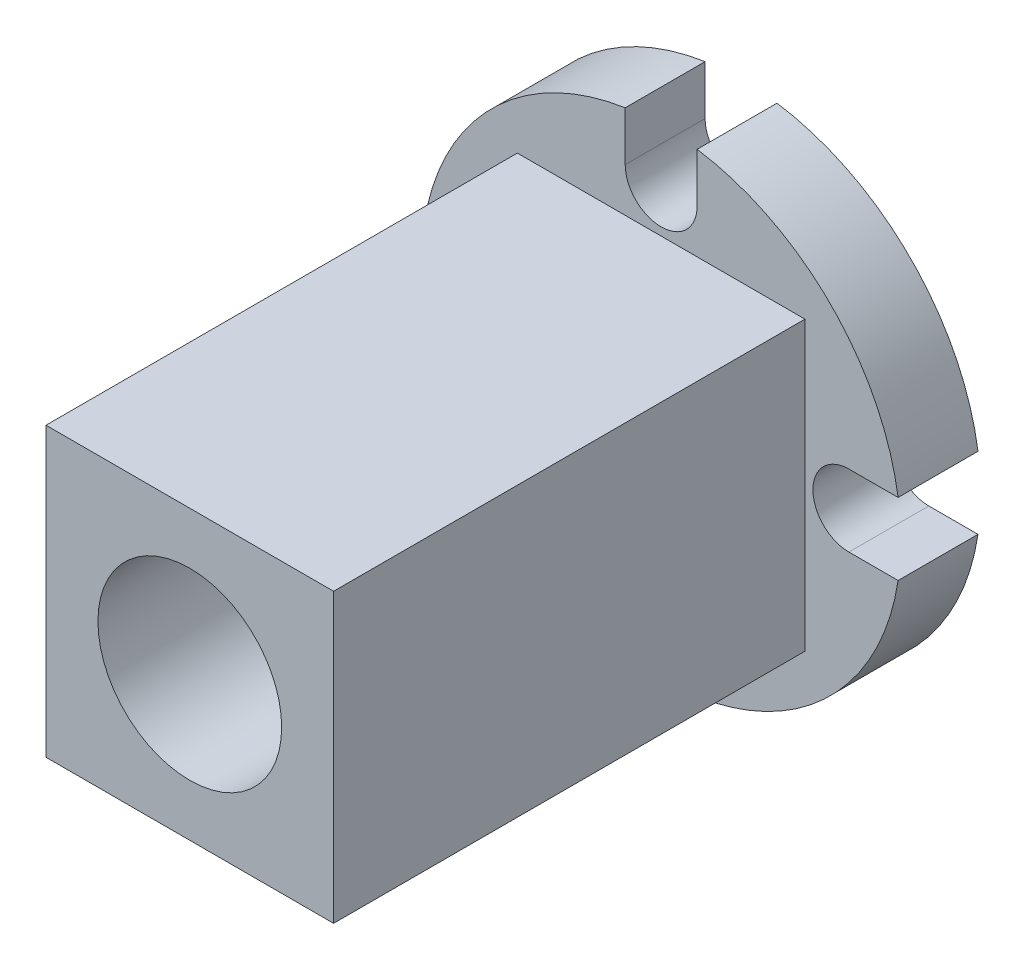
ISO-10303-21;
HEADER;
FILE_DESCRIPTION(('STEP AP214'),'2;1');
FILE_NAME('part.step','',(''),(''),'','','');
FILE_SCHEMA(('AUTOMOTIVE_DESIGN { 1 0 10303 214 1 1 1 1 }'));
ENDSEC;
DATA;
#1=APPLICATION_CONTEXT('core data for automotive mechanical design processes');
#2=APPLICATION_PROTOCOL_DEFINITION('international standard','automotive_design',2000,#1);
#3=PRODUCT_CONTEXT('',#1,'mechanical');
#4=PRODUCT('Part','Part','',(#3));
#5=PRODUCT_RELATED_PRODUCT_CATEGORY('part','',(#4));
#6=PRODUCT_DEFINITION_FORMATION('','',#4);
#7=PRODUCT_DEFINITION_CONTEXT('part definition',#1,'design');
#8=PRODUCT_DEFINITION('design','',#6,#7);
#9=PRODUCT_DEFINITION_SHAPE('','',#8);
#10=(LENGTH_UNIT() NAMED_UNIT(*) SI_UNIT(.MILLI.,.METRE.));
#11=(NAMED_UNIT(*) PLANE_ANGLE_UNIT() SI_UNIT($,.RADIAN.));
#12=(NAMED_UNIT(*) SI_UNIT($,.STERADIAN.) SOLID_ANGLE_UNIT());
#13=UNCERTAINTY_MEASURE_WITH_UNIT(LENGTH_MEASURE(1.E-05),#10,'distance_accuracy_value','');
#14=(GEOMETRIC_REPRESENTATION_CONTEXT(3) GLOBAL_UNCERTAINTY_ASSIGNED_CONTEXT((#13)) GLOBAL_UNIT_ASSIGNED_CONTEXT((#10,
#11,#12)) REPRESENTATION_CONTEXT('',''));
#15=CARTESIAN_POINT('',(0.,0.,0.));
#16=DIRECTION('',(0.,0.,1.));
#17=DIRECTION('',(1.,0.,0.));
#18=AXIS2_PLACEMENT_3D('',#15,#16,#17);
#19=CARTESIAN_POINT('',(-18.,18.,69.));
#20=DIRECTION('',(0.,0.,1.));
#21=DIRECTION('',(0.,-1.,0.));
#22=AXIS2_PLACEMENT_3D('',#19,#20,#21);
#23=PLANE('',#22);
#24=DIRECTION('',(-1.,0.,0.));
#25=VECTOR('',#24,1.);
#26=CARTESIAN_POINT('',(18.,18.,69.));
#27=LINE('',#26,#25);
#28=CARTESIAN_POINT('',(18.,18.,69.));
#29=VERTEX_POINT('',#28);
#30=CARTESIAN_POINT('',(-18.,18.,69.));
#31=VERTEX_POINT('',#30);
#32=EDGE_CURVE('E406',#29,#31,#27,.T.);
#33=ORIENTED_EDGE('',*,*,#32,.T.);
#34=DIRECTION('',(0.,-1.,0.));
#35=VECTOR('',#34,1.);
#36=CARTESIAN_POINT('',(-18.,18.,69.));
#37=LINE('',#36,#35);
#38=CARTESIAN_POINT('',(-18.,-18.,69.));
#39=VERTEX_POINT('',#38);
#40=EDGE_CURVE('E421',#31,#39,#37,.T.);
#41=ORIENTED_EDGE('',*,*,#40,.T.);
#42=DIRECTION('',(1.,0.,0.));
#43=VECTOR('',#42,1.);
#44=CARTESIAN_POINT('',(18.,-18.,69.));
#45=LINE('',#44,#43);
#46=CARTESIAN_POINT('',(18.,-18.,69.));
#47=VERTEX_POINT('',#46);
#48=EDGE_CURVE('E418',#39,#47,#45,.T.);
#49=ORIENTED_EDGE('',*,*,#48,.T.);
#50=DIRECTION('',(0.,1.,0.));
#51=VECTOR('',#50,1.);
#52=CARTESIAN_POINT('',(18.,18.,69.));
#53=LINE('',#52,#51);
#54=EDGE_CURVE('E403',#47,#29,#53,.T.);
#55=ORIENTED_EDGE('',*,*,#54,.T.);
#56=EDGE_LOOP('',(#33,#41,#49,#55));
#57=FACE_BOUND('',#56,.T.);
#58=CARTESIAN_POINT('',(0.,0.,69.));
#59=DIRECTION('',(0.,0.,1.));
#60=DIRECTION('',(1.,0.,0.));
#61=AXIS2_PLACEMENT_3D('',#58,#59,#60);
#62=CIRCLE('',#61,11.5);
#63=CARTESIAN_POINT('',(11.5,0.,69.));
#64=VERTEX_POINT('',#63);
#65=EDGE_CURVE('E415',#64,#64,#62,.T.);
#66=ORIENTED_EDGE('',*,*,#65,.F.);
#67=EDGE_LOOP('',(#66));
#68=FACE_BOUND('',#67,.T.);
#69=ADVANCED_FACE('F14',(#57,#68),#23,.T.);
#70=CARTESIAN_POINT('',(0.,0.,10.));
#71=DIRECTION('',(0.,0.,1.));
#72=DIRECTION('',(0.,-1.,0.));
#73=AXIS2_PLACEMENT_3D('',#70,#71,#72);
#74=PLANE('',#73);
#75=CARTESIAN_POINT('',(0.,0.,10.));
#76=DIRECTION('',(0.,0.,1.));
#77=DIRECTION('',(0.,-1.,0.));
#78=AXIS2_PLACEMENT_3D('',#75,#76,#77);
#79=CIRCLE('',#78,30.);
#80=CARTESIAN_POINT('',(29.6605798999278,4.5,10.));
#81=VERTEX_POINT('',#80);
#82=CARTESIAN_POINT('',(4.5,29.6605798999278,10.));
#83=VERTEX_POINT('',#82);
#84=EDGE_CURVE('E205',#81,#83,#79,.T.);
#85=ORIENTED_EDGE('',*,*,#84,.T.);
#86=DIRECTION('',(0.,-1.,0.));
#87=VECTOR('',#86,1.);
#88=CARTESIAN_POINT('',(4.5,29.6605798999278,10.));
#89=LINE('',#88,#87);
#90=CARTESIAN_POINT('',(4.5,23.5,10.));
#91=VERTEX_POINT('',#90);
#92=EDGE_CURVE('E104',#83,#91,#89,.T.);
#93=ORIENTED_EDGE('',*,*,#92,.T.);
#94=CARTESIAN_POINT('',(0.,23.5,10.));
#95=DIRECTION('',(0.,0.,-1.));
#96=DIRECTION('',(0.,-1.,0.));
#97=AXIS2_PLACEMENT_3D('',#94,#95,#96);
#98=CIRCLE('',#97,4.5);
#99=CARTESIAN_POINT('',(-4.5,23.5,10.));
#100=VERTEX_POINT('',#99);
#101=EDGE_CURVE('E364',#91,#100,#98,.T.);
#102=ORIENTED_EDGE('',*,*,#101,.T.);
#103=DIRECTION('',(0.,1.,0.));
#104=VECTOR('',#103,1.);
#105=CARTESIAN_POINT('',(-4.5,29.6605798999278,10.));
#106=LINE('',#105,#104);
#107=CARTESIAN_POINT('',(-4.5,29.6605798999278,10.));
#108=VERTEX_POINT('',#107);
#109=EDGE_CURVE('E366',#100,#108,#106,.T.);
#110=ORIENTED_EDGE('',*,*,#109,.T.);
#111=CARTESIAN_POINT('',(0.,0.,10.));
#112=DIRECTION('',(0.,0.,1.));
#113=DIRECTION('',(0.,-1.,0.));
#114=AXIS2_PLACEMENT_3D('',#111,#112,#113);
#115=CIRCLE('',#114,30.);
#116=CARTESIAN_POINT('',(-29.6605798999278,4.5,10.));
#117=VERTEX_POINT('',#116);
#118=EDGE_CURVE('E368',#108,#117,#115,.T.);
#119=ORIENTED_EDGE('',*,*,#118,.T.);
#120=DIRECTION('',(1.,0.,0.));
#121=VECTOR('',#120,1.);
#122=CARTESIAN_POINT('',(-29.6605798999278,4.5,10.));
#123=LINE('',#122,#121);
#124=CARTESIAN_POINT('',(-23.5,4.5,10.));
#125=VERTEX_POINT('',#124);
#126=EDGE_CURVE('E374',#117,#125,#123,.T.);
#127=ORIENTED_EDGE('',*,*,#126,.T.);
#128=CARTESIAN_POINT('',(-23.5,0.,10.));
#129=DIRECTION('',(0.,0.,-1.));
#130=DIRECTION('',(0.,-1.,0.));
#131=AXIS2_PLACEMENT_3D('',#128,#129,#130);
#132=CIRCLE('',#131,4.5);
#133=CARTESIAN_POINT('',(-23.5,-4.5,10.));
#134=VERTEX_POINT('',#133);
#135=EDGE_CURVE('E376',#125,#134,#132,.T.);
#136=ORIENTED_EDGE('',*,*,#135,.T.);
#137=DIRECTION('',(-1.,0.,0.));
#138=VECTOR('',#137,1.);
#139=CARTESIAN_POINT('',(-29.6605798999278,-4.5,10.));
#140=LINE('',#139,#138);
#141=CARTESIAN_POINT('',(-29.6605798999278,-4.5,10.));
#142=VERTEX_POINT('',#141);
#143=EDGE_CURVE('E378',#134,#142,#140,.T.);
#144=ORIENTED_EDGE('',*,*,#143,.T.);
#145=CARTESIAN_POINT('',(0.,0.,10.));
#146=DIRECTION('',(0.,0.,1.));
#147=DIRECTION('',(0.,-1.,0.));
#148=AXIS2_PLACEMENT_3D('',#145,#146,#147);
#149=CIRCLE('',#148,30.);
#150=CARTESIAN_POINT('',(-4.5,-29.6605798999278,10.));
#151=VERTEX_POINT('',#150);
#152=EDGE_CURVE('E380',#142,#151,#149,.T.);
#153=ORIENTED_EDGE('',*,*,#152,.T.);
#154=DIRECTION('',(0.,1.,0.));
#155=VECTOR('',#154,1.);
#156=CARTESIAN_POINT('',(-4.5,-29.6605798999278,10.));
#157=LINE('',#156,#155);
#158=CARTESIAN_POINT('',(-4.5,-23.5,10.));
#159=VERTEX_POINT('',#158);
#160=EDGE_CURVE('E382',#151,#159,#157,.T.);
#161=ORIENTED_EDGE('',*,*,#160,.T.);
#162=CARTESIAN_POINT('',(0.,-23.5,10.));
#163=DIRECTION('',(0.,0.,-1.));
#164=DIRECTION('',(0.,-1.,0.));
#165=AXIS2_PLACEMENT_3D('',#162,#163,#164);
#166=CIRCLE('',#165,4.5);
#167=CARTESIAN_POINT('',(4.5,-23.5,10.));
#168=VERTEX_POINT('',#167);
#169=EDGE_CURVE('E384',#159,#168,#166,.T.);
#170=ORIENTED_EDGE('',*,*,#169,.T.);
#171=DIRECTION('',(0.,-1.,0.));
#172=VECTOR('',#171,1.);
#173=CARTESIAN_POINT('',(4.5,-29.6605798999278,10.));
#174=LINE('',#173,#172);
#175=CARTESIAN_POINT('',(4.5,-29.6605798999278,10.));
#176=VERTEX_POINT('',#175);
#177=EDGE_CURVE('E386',#168,#176,#174,.T.);
#178=ORIENTED_EDGE('',*,*,#177,.T.);
#179=CARTESIAN_POINT('',(0.,0.,10.));
#180=DIRECTION('',(0.,0.,1.));
#181=DIRECTION('',(0.,-1.,0.));
#182=AXIS2_PLACEMENT_3D('',#179,#180,#181);
#183=CIRCLE('',#182,30.);
#184=CARTESIAN_POINT('',(29.6605798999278,-4.5,10.));
#185=VERTEX_POINT('',#184);
#186=EDGE_CURVE('E152',#176,#185,#183,.T.);
#187=ORIENTED_EDGE('',*,*,#186,.T.);
#188=DIRECTION('',(-1.,0.,0.));
#189=VECTOR('',#188,1.);
#190=CARTESIAN_POINT('',(29.6605798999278,-4.5,10.));
#191=LINE('',#190,#189);
#192=CARTESIAN_POINT('',(23.5,-4.5,10.));
#193=VERTEX_POINT('',#192);
#194=EDGE_CURVE('E144',#185,#193,#191,.T.);
#195=ORIENTED_EDGE('',*,*,#194,.T.);
#196=CARTESIAN_POINT('',(23.5,0.,10.));
#197=DIRECTION('',(0.,0.,-1.));
#198=DIRECTION('',(0.,-1.,0.));
#199=AXIS2_PLACEMENT_3D('',#196,#197,#198);
#200=CIRCLE('',#199,4.5);
#201=CARTESIAN_POINT('',(23.5,4.5,10.));
#202=VERTEX_POINT('',#201);
#203=EDGE_CURVE('E149',#193,#202,#200,.T.);
#204=ORIENTED_EDGE('',*,*,#203,.T.);
#205=DIRECTION('',(1.,0.,0.));
#206=VECTOR('',#205,1.);
#207=CARTESIAN_POINT('',(29.6605798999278,4.5,10.));
#208=LINE('',#207,#206);
#209=EDGE_CURVE('E38',#202,#81,#208,.T.);
#210=ORIENTED_EDGE('',*,*,#209,.T.);
#211=EDGE_LOOP('',(#85,#93,#102,#110,#119,#127,#136,#144,#153,#161,#170,#178,#187,#195,#204,#210));
#212=FACE_BOUND('',#211,.T.);
#213=DIRECTION('',(0.,-1.,0.));
#214=VECTOR('',#213,1.);
#215=CARTESIAN_POINT('',(-18.,18.,10.));
#216=LINE('',#215,#214);
#217=CARTESIAN_POINT('',(-18.,18.,10.));
#218=VERTEX_POINT('',#217);
#219=CARTESIAN_POINT('',(-18.,-18.,10.));
#220=VERTEX_POINT('',#219);
#221=EDGE_CURVE('E409',#218,#220,#216,.T.);
#222=ORIENTED_EDGE('',*,*,#221,.F.);
#223=DIRECTION('',(-1.,0.,0.));
#224=VECTOR('',#223,1.);
#225=CARTESIAN_POINT('',(18.,18.,10.));
#226=LINE('',#225,#224);
#227=CARTESIAN_POINT('',(18.,18.,10.));
#228=VERTEX_POINT('',#227);
#229=EDGE_CURVE('E412',#228,#218,#226,.T.);
#230=ORIENTED_EDGE('',*,*,#229,.F.);
#231=DIRECTION('',(0.,1.,0.));
#232=VECTOR('',#231,1.);
#233=CARTESIAN_POINT('',(18.,18.,10.));
#234=LINE('',#233,#232);
#235=CARTESIAN_POINT('',(18.,-18.,10.));
#236=VERTEX_POINT('',#235);
#237=EDGE_CURVE('E404',#236,#228,#234,.T.);
#238=ORIENTED_EDGE('',*,*,#237,.F.);
#239=DIRECTION('',(1.,0.,0.));
#240=VECTOR('',#239,1.);
#241=CARTESIAN_POINT('',(18.,-18.,10.));
#242=LINE('',#241,#240);
#243=EDGE_CURVE('E407',#220,#236,#242,.T.);
#244=ORIENTED_EDGE('',*,*,#243,.F.);
#245=EDGE_LOOP('',(#222,#230,#238,#244));
#246=FACE_BOUND('',#245,.T.);
#247=ADVANCED_FACE('F146',(#212,#246),#74,.T.);
#248=CARTESIAN_POINT('',(0.,0.,10.));
#249=DIRECTION('',(0.,0.,-1.));
#250=DIRECTION('',(0.,1.,0.));
#251=AXIS2_PLACEMENT_3D('',#248,#249,#250);
#252=CYLINDRICAL_SURFACE('',#251,30.);
#253=CARTESIAN_POINT('',(0.,0.,0.));
#254=DIRECTION('',(0.,0.,1.));
#255=DIRECTION('',(0.,-1.,0.));
#256=AXIS2_PLACEMENT_3D('',#253,#254,#255);
#257=CIRCLE('',#256,30.);
#258=CARTESIAN_POINT('',(29.6605798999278,4.5,0.));
#259=VERTEX_POINT('',#258);
#260=CARTESIAN_POINT('',(4.5,29.6605798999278,0.));
#261=VERTEX_POINT('',#260);
#262=EDGE_CURVE('E173',#259,#261,#257,.T.);
#263=ORIENTED_EDGE('',*,*,#262,.T.);
#264=DIRECTION('',(0.,0.,-1.));
#265=VECTOR('',#264,1.);
#266=CARTESIAN_POINT('',(4.5,29.6605798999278,10.));
#267=LINE('',#266,#265);
#268=EDGE_CURVE('E242',#83,#261,#267,.T.);
#269=ORIENTED_EDGE('',*,*,#268,.F.);
#270=ORIENTED_EDGE('',*,*,#84,.F.);
#271=DIRECTION('',(0.,0.,-1.));
#272=VECTOR('',#271,1.);
#273=CARTESIAN_POINT('',(29.6605798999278,4.5,10.));
#274=LINE('',#273,#272);
#275=EDGE_CURVE('E169',#81,#259,#274,.T.);
#276=ORIENTED_EDGE('',*,*,#275,.T.);
#277=EDGE_LOOP('',(#263,#269,#270,#276));
#278=FACE_BOUND('',#277,.T.);
#279=ADVANCED_FACE('F270',(#278),#252,.T.);
#280=CARTESIAN_POINT('',(4.5,29.6605798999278,10.));
#281=DIRECTION('',(1.,0.,0.));
#282=DIRECTION('',(0.,0.,1.));
#283=AXIS2_PLACEMENT_3D('',#280,#281,#282);
#284=PLANE('',#283);
#285=DIRECTION('',(0.,-1.,0.));
#286=VECTOR('',#285,1.);
#287=CARTESIAN_POINT('',(4.5,29.6605798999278,0.));
#288=LINE('',#287,#286);
#289=CARTESIAN_POINT('',(4.5,23.5,0.));
#290=VERTEX_POINT('',#289);
#291=EDGE_CURVE('E176',#261,#290,#288,.T.);
#292=ORIENTED_EDGE('',*,*,#291,.T.);
#293=DIRECTION('',(0.,0.,-1.));
#294=VECTOR('',#293,1.);
#295=CARTESIAN_POINT('',(4.5,23.5,10.));
#296=LINE('',#295,#294);
#297=EDGE_CURVE('E239',#91,#290,#296,.T.);
#298=ORIENTED_EDGE('',*,*,#297,.F.);
#299=ORIENTED_EDGE('',*,*,#92,.F.);
#300=ORIENTED_EDGE('',*,*,#268,.T.);
#301=EDGE_LOOP('',(#292,#298,#299,#300));
#302=FACE_BOUND('',#301,.T.);
#303=ADVANCED_FACE('F348',(#302),#284,.F.);
#304=CARTESIAN_POINT('',(0.,23.5,10.));
#305=DIRECTION('',(0.,0.,-1.));
#306=DIRECTION('',(0.,1.,0.));
#307=AXIS2_PLACEMENT_3D('',#304,#305,#306);
#308=CYLINDRICAL_SURFACE('',#307,4.5);
#309=CARTESIAN_POINT('',(0.,23.5,0.));
#310=DIRECTION('',(0.,0.,-1.));
#311=DIRECTION('',(0.,-1.,0.));
#312=AXIS2_PLACEMENT_3D('',#309,#310,#311);
#313=CIRCLE('',#312,4.5);
#314=CARTESIAN_POINT('',(-4.5,23.5,0.));
#315=VERTEX_POINT('',#314);
#316=EDGE_CURVE('E179',#290,#315,#313,.T.);
#317=ORIENTED_EDGE('',*,*,#316,.T.);
#318=DIRECTION('',(0.,0.,-1.));
#319=VECTOR('',#318,1.);
#320=CARTESIAN_POINT('',(-4.5,23.5,10.));
#321=LINE('',#320,#319);
#322=EDGE_CURVE('E236',#100,#315,#321,.T.);
#323=ORIENTED_EDGE('',*,*,#322,.F.);
#324=ORIENTED_EDGE('',*,*,#101,.F.);
#325=ORIENTED_EDGE('',*,*,#297,.T.);
#326=EDGE_LOOP('',(#317,#323,#324,#325));
#327=FACE_BOUND('',#326,.T.);
#328=ADVANCED_FACE('F344',(#327),#308,.F.);
#329=CARTESIAN_POINT('',(-4.5,29.6605798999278,10.));
#330=DIRECTION('',(-1.,0.,0.));
#331=DIRECTION('',(0.,0.,-1.));
#332=AXIS2_PLACEMENT_3D('',#329,#330,#331);
#333=PLANE('',#332);
#334=DIRECTION('',(0.,1.,0.));
#335=VECTOR('',#334,1.);
#336=CARTESIAN_POINT('',(-4.5,29.6605798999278,0.));
#337=LINE('',#336,#335);
#338=CARTESIAN_POINT('',(-4.5,29.6605798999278,0.));
#339=VERTEX_POINT('',#338);
#340=EDGE_CURVE('E181',#315,#339,#337,.T.);
#341=ORIENTED_EDGE('',*,*,#340,.T.);
#342=DIRECTION('',(0.,0.,-1.));
#343=VECTOR('',#342,1.);
#344=CARTESIAN_POINT('',(-4.5,29.6605798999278,10.));
#345=LINE('',#344,#343);
#346=EDGE_CURVE('E233',#108,#339,#345,.T.);
#347=ORIENTED_EDGE('',*,*,#346,.F.);
#348=ORIENTED_EDGE('',*,*,#109,.F.);
#349=ORIENTED_EDGE('',*,*,#322,.T.);
#350=EDGE_LOOP('',(#341,#347,#348,#349));
#351=FACE_BOUND('',#350,.T.);
#352=ADVANCED_FACE('F340',(#351),#333,.F.);
#353=CARTESIAN_POINT('',(0.,0.,10.));
#354=DIRECTION('',(0.,0.,-1.));
#355=DIRECTION('',(0.,1.,0.));
#356=AXIS2_PLACEMENT_3D('',#353,#354,#355);
#357=CYLINDRICAL_SURFACE('',#356,30.);
#358=CARTESIAN_POINT('',(0.,0.,0.));
#359=DIRECTION('',(0.,0.,1.));
#360=DIRECTION('',(0.,-1.,0.));
#361=AXIS2_PLACEMENT_3D('',#358,#359,#360);
#362=CIRCLE('',#361,30.);
#363=CARTESIAN_POINT('',(-29.6605798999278,4.5,0.));
#364=VERTEX_POINT('',#363);
#365=EDGE_CURVE('E183',#339,#364,#362,.T.);
#366=ORIENTED_EDGE('',*,*,#365,.T.);
#367=DIRECTION('',(0.,0.,-1.));
#368=VECTOR('',#367,1.);
#369=CARTESIAN_POINT('',(-29.6605798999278,4.5,10.));
#370=LINE('',#369,#368);
#371=EDGE_CURVE('E230',#117,#364,#370,.T.);
#372=ORIENTED_EDGE('',*,*,#371,.F.);
#373=ORIENTED_EDGE('',*,*,#118,.F.);
#374=ORIENTED_EDGE('',*,*,#346,.T.);
#375=EDGE_LOOP('',(#366,#372,#373,#374));
#376=FACE_BOUND('',#375,.T.);
#377=ADVANCED_FACE('F336',(#376),#357,.T.);
#378=CARTESIAN_POINT('',(-29.6605798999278,4.5,10.));
#379=DIRECTION('',(0.,1.,0.));
#380=DIRECTION('',(-1.,0.,0.));
#381=AXIS2_PLACEMENT_3D('',#378,#379,#380);
#382=PLANE('',#381);
#383=DIRECTION('',(1.,0.,0.));
#384=VECTOR('',#383,1.);
#385=CARTESIAN_POINT('',(-29.6605798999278,4.5,0.));
#386=LINE('',#385,#384);
#387=CARTESIAN_POINT('',(-23.5,4.5,0.));
#388=VERTEX_POINT('',#387);
#389=EDGE_CURVE('E185',#364,#388,#386,.T.);
#390=ORIENTED_EDGE('',*,*,#389,.T.);
#391=DIRECTION('',(0.,0.,-1.));
#392=VECTOR('',#391,1.);
#393=CARTESIAN_POINT('',(-23.5,4.5,10.));
#394=LINE('',#393,#392);
#395=EDGE_CURVE('E227',#125,#388,#394,.T.);
#396=ORIENTED_EDGE('',*,*,#395,.F.);
#397=ORIENTED_EDGE('',*,*,#126,.F.);
#398=ORIENTED_EDGE('',*,*,#371,.T.);
#399=EDGE_LOOP('',(#390,#396,#397,#398));
#400=FACE_BOUND('',#399,.T.);
#401=ADVANCED_FACE('F332',(#400),#382,.F.);
#402=CARTESIAN_POINT('',(-23.5,0.,10.));
#403=DIRECTION('',(0.,0.,-1.));
#404=DIRECTION('',(0.,1.,0.));
#405=AXIS2_PLACEMENT_3D('',#402,#403,#404);
#406=CYLINDRICAL_SURFACE('',#405,4.5);
#407=CARTESIAN_POINT('',(-23.5,0.,0.));
#408=DIRECTION('',(0.,0.,-1.));
#409=DIRECTION('',(0.,-1.,0.));
#410=AXIS2_PLACEMENT_3D('',#407,#408,#409);
#411=CIRCLE('',#410,4.5);
#412=CARTESIAN_POINT('',(-23.5,-4.5,0.));
#413=VERTEX_POINT('',#412);
#414=EDGE_CURVE('E187',#388,#413,#411,.T.);
#415=ORIENTED_EDGE('',*,*,#414,.T.);
#416=DIRECTION('',(0.,0.,-1.));
#417=VECTOR('',#416,1.);
#418=CARTESIAN_POINT('',(-23.5,-4.5,10.));
#419=LINE('',#418,#417);
#420=EDGE_CURVE('E224',#134,#413,#419,.T.);
#421=ORIENTED_EDGE('',*,*,#420,.F.);
#422=ORIENTED_EDGE('',*,*,#135,.F.);
#423=ORIENTED_EDGE('',*,*,#395,.T.);
#424=EDGE_LOOP('',(#415,#421,#422,#423));
#425=FACE_BOUND('',#424,.T.);
#426=ADVANCED_FACE('F328',(#425),#406,.F.);
#427=CARTESIAN_POINT('',(-29.6605798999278,-4.5,10.));
#428=DIRECTION('',(0.,-1.,0.));
#429=DIRECTION('',(1.,0.,0.));
#430=AXIS2_PLACEMENT_3D('',#427,#428,#429);
#431=PLANE('',#430);
#432=DIRECTION('',(-1.,0.,0.));
#433=VECTOR('',#432,1.);
#434=CARTESIAN_POINT('',(-29.6605798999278,-4.5,0.));
#435=LINE('',#434,#433);
#436=CARTESIAN_POINT('',(-29.6605798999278,-4.5,0.));
#437=VERTEX_POINT('',#436);
#438=EDGE_CURVE('E189',#413,#437,#435,.T.);
#439=ORIENTED_EDGE('',*,*,#438,.T.);
#440=DIRECTION('',(0.,0.,-1.));
#441=VECTOR('',#440,1.);
#442=CARTESIAN_POINT('',(-29.6605798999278,-4.5,10.));
#443=LINE('',#442,#441);
#444=EDGE_CURVE('E221',#142,#437,#443,.T.);
#445=ORIENTED_EDGE('',*,*,#444,.F.);
#446=ORIENTED_EDGE('',*,*,#143,.F.);
#447=ORIENTED_EDGE('',*,*,#420,.T.);
#448=EDGE_LOOP('',(#439,#445,#446,#447));
#449=FACE_BOUND('',#448,.T.);
#450=ADVANCED_FACE('F324',(#449),#431,.F.);
#451=CARTESIAN_POINT('',(0.,0.,10.));
#452=DIRECTION('',(0.,0.,-1.));
#453=DIRECTION('',(0.,1.,0.));
#454=AXIS2_PLACEMENT_3D('',#451,#452,#453);
#455=CYLINDRICAL_SURFACE('',#454,30.);
#456=CARTESIAN_POINT('',(0.,0.,0.));
#457=DIRECTION('',(0.,0.,1.));
#458=DIRECTION('',(0.,-1.,0.));
#459=AXIS2_PLACEMENT_3D('',#456,#457,#458);
#460=CIRCLE('',#459,30.);
#461=CARTESIAN_POINT('',(-4.5,-29.6605798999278,0.));
#462=VERTEX_POINT('',#461);
#463=EDGE_CURVE('E191',#437,#462,#460,.T.);
#464=ORIENTED_EDGE('',*,*,#463,.T.);
#465=DIRECTION('',(0.,0.,-1.));
#466=VECTOR('',#465,1.);
#467=CARTESIAN_POINT('',(-4.5,-29.6605798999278,10.));
#468=LINE('',#467,#466);
#469=EDGE_CURVE('E218',#151,#462,#468,.T.);
#470=ORIENTED_EDGE('',*,*,#469,.F.);
#471=ORIENTED_EDGE('',*,*,#152,.F.);
#472=ORIENTED_EDGE('',*,*,#444,.T.);
#473=EDGE_LOOP('',(#464,#470,#471,#472));
#474=FACE_BOUND('',#473,.T.);
#475=ADVANCED_FACE('F320',(#474),#455,.T.);
#476=CARTESIAN_POINT('',(-4.5,-29.6605798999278,10.));
#477=DIRECTION('',(-1.,0.,0.));
#478=DIRECTION('',(0.,-1.,0.));
#479=AXIS2_PLACEMENT_3D('',#476,#477,#478);
#480=PLANE('',#479);
#481=DIRECTION('',(0.,1.,0.));
#482=VECTOR('',#481,1.);
#483=CARTESIAN_POINT('',(-4.5,-29.6605798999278,0.));
#484=LINE('',#483,#482);
#485=CARTESIAN_POINT('',(-4.5,-23.5,0.));
#486=VERTEX_POINT('',#485);
#487=EDGE_CURVE('E193',#462,#486,#484,.T.);
#488=ORIENTED_EDGE('',*,*,#487,.T.);
#489=DIRECTION('',(0.,0.,-1.));
#490=VECTOR('',#489,1.);
#491=CARTESIAN_POINT('',(-4.5,-23.5,10.));
#492=LINE('',#491,#490);
#493=EDGE_CURVE('E215',#159,#486,#492,.T.);
#494=ORIENTED_EDGE('',*,*,#493,.F.);
#495=ORIENTED_EDGE('',*,*,#160,.F.);
#496=ORIENTED_EDGE('',*,*,#469,.T.);
#497=EDGE_LOOP('',(#488,#494,#495,#496));
#498=FACE_BOUND('',#497,.T.);
#499=ADVANCED_FACE('F316',(#498),#480,.F.);
#500=CARTESIAN_POINT('',(0.,-23.5,10.));
#501=DIRECTION('',(0.,0.,-1.));
#502=DIRECTION('',(0.,1.,0.));
#503=AXIS2_PLACEMENT_3D('',#500,#501,#502);
#504=CYLINDRICAL_SURFACE('',#503,4.5);
#505=CARTESIAN_POINT('',(0.,-23.5,0.));
#506=DIRECTION('',(0.,0.,-1.));
#507=DIRECTION('',(0.,-1.,0.));
#508=AXIS2_PLACEMENT_3D('',#505,#506,#507);
#509=CIRCLE('',#508,4.5);
#510=CARTESIAN_POINT('',(4.5,-23.5,0.));
#511=VERTEX_POINT('',#510);
#512=EDGE_CURVE('E195',#486,#511,#509,.T.);
#513=ORIENTED_EDGE('',*,*,#512,.T.);
#514=DIRECTION('',(0.,0.,-1.));
#515=VECTOR('',#514,1.);
#516=CARTESIAN_POINT('',(4.5,-23.5,10.));
#517=LINE('',#516,#515);
#518=EDGE_CURVE('E212',#168,#511,#517,.T.);
#519=ORIENTED_EDGE('',*,*,#518,.F.);
#520=ORIENTED_EDGE('',*,*,#169,.F.);
#521=ORIENTED_EDGE('',*,*,#493,.T.);
#522=EDGE_LOOP('',(#513,#519,#520,#521));
#523=FACE_BOUND('',#522,.T.);
#524=ADVANCED_FACE('F312',(#523),#504,.F.);
#525=CARTESIAN_POINT('',(4.5,-29.6605798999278,10.));
#526=DIRECTION('',(1.,0.,0.));
#527=DIRECTION('',(0.,1.,0.));
#528=AXIS2_PLACEMENT_3D('',#525,#526,#527);
#529=PLANE('',#528);
#530=DIRECTION('',(0.,-1.,0.));
#531=VECTOR('',#530,1.);
#532=CARTESIAN_POINT('',(4.5,-29.6605798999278,0.));
#533=LINE('',#532,#531);
#534=CARTESIAN_POINT('',(4.5,-29.6605798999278,0.));
#535=VERTEX_POINT('',#534);
#536=EDGE_CURVE('E197',#511,#535,#533,.T.);
#537=ORIENTED_EDGE('',*,*,#536,.T.);
#538=DIRECTION('',(0.,0.,-1.));
#539=VECTOR('',#538,1.);
#540=CARTESIAN_POINT('',(4.5,-29.6605798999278,10.));
#541=LINE('',#540,#539);
#542=EDGE_CURVE('E209',#176,#535,#541,.T.);
#543=ORIENTED_EDGE('',*,*,#542,.F.);
#544=ORIENTED_EDGE('',*,*,#177,.F.);
#545=ORIENTED_EDGE('',*,*,#518,.T.);
#546=EDGE_LOOP('',(#537,#543,#544,#545));
#547=FACE_BOUND('',#546,.T.);
#548=ADVANCED_FACE('F308',(#547),#529,.F.);
#549=CARTESIAN_POINT('',(0.,0.,10.));
#550=DIRECTION('',(0.,0.,-1.));
#551=DIRECTION('',(0.,1.,0.));
#552=AXIS2_PLACEMENT_3D('',#549,#550,#551);
#553=CYLINDRICAL_SURFACE('',#552,30.);
#554=CARTESIAN_POINT('',(0.,0.,0.));
#555=DIRECTION('',(0.,0.,1.));
#556=DIRECTION('',(0.,-1.,0.));
#557=AXIS2_PLACEMENT_3D('',#554,#555,#556);
#558=CIRCLE('',#557,30.);
#559=CARTESIAN_POINT('',(29.6605798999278,-4.5,0.));
#560=VERTEX_POINT('',#559);
#561=EDGE_CURVE('E199',#535,#560,#558,.T.);
#562=ORIENTED_EDGE('',*,*,#561,.T.);
#563=DIRECTION('',(0.,0.,-1.));
#564=VECTOR('',#563,1.);
#565=CARTESIAN_POINT('',(29.6605798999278,-4.5,10.));
#566=LINE('',#565,#564);
#567=EDGE_CURVE('E164',#185,#560,#566,.T.);
#568=ORIENTED_EDGE('',*,*,#567,.F.);
#569=ORIENTED_EDGE('',*,*,#186,.F.);
#570=ORIENTED_EDGE('',*,*,#542,.T.);
#571=EDGE_LOOP('',(#562,#568,#569,#570));
#572=FACE_BOUND('',#571,.T.);
#573=ADVANCED_FACE('F305',(#572),#553,.T.);
#574=CARTESIAN_POINT('',(29.6605798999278,-4.5,10.));
#575=DIRECTION('',(0.,-1.,0.));
#576=DIRECTION('',(1.,0.,0.));
#577=AXIS2_PLACEMENT_3D('',#574,#575,#576);
#578=PLANE('',#577);
#579=DIRECTION('',(-1.,0.,0.));
#580=VECTOR('',#579,1.);
#581=CARTESIAN_POINT('',(29.6605798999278,-4.5,0.));
#582=LINE('',#581,#580);
#583=CARTESIAN_POINT('',(23.5,-4.5,0.));
#584=VERTEX_POINT('',#583);
#585=EDGE_CURVE('E161',#560,#584,#582,.T.);
#586=ORIENTED_EDGE('',*,*,#585,.T.);
#587=DIRECTION('',(0.,0.,-1.));
#588=VECTOR('',#587,1.);
#589=CARTESIAN_POINT('',(23.5,-4.5,10.));
#590=LINE('',#589,#588);
#591=EDGE_CURVE('E158',#193,#584,#590,.T.);
#592=ORIENTED_EDGE('',*,*,#591,.F.);
#593=ORIENTED_EDGE('',*,*,#194,.F.);
#594=ORIENTED_EDGE('',*,*,#567,.T.);
#595=EDGE_LOOP('',(#586,#592,#593,#594));
#596=FACE_BOUND('',#595,.T.);
#597=ADVANCED_FACE('F159',(#596),#578,.F.);
#598=CARTESIAN_POINT('',(23.5,0.,10.));
#599=DIRECTION('',(0.,0.,-1.));
#600=DIRECTION('',(0.,1.,0.));
#601=AXIS2_PLACEMENT_3D('',#598,#599,#600);
#602=CYLINDRICAL_SURFACE('',#601,4.5);
#603=CARTESIAN_POINT('',(23.5,0.,0.));
#604=DIRECTION('',(0.,0.,-1.));
#605=DIRECTION('',(0.,-1.,0.));
#606=AXIS2_PLACEMENT_3D('',#603,#604,#605);
#607=CIRCLE('',#606,4.5);
#608=CARTESIAN_POINT('',(23.5,4.5,0.));
#609=VERTEX_POINT('',#608);
#610=EDGE_CURVE('E202',#584,#609,#607,.T.);
#611=ORIENTED_EDGE('',*,*,#610,.T.);
#612=DIRECTION('',(0.,0.,-1.));
#613=VECTOR('',#612,1.);
#614=CARTESIAN_POINT('',(23.5,4.5,10.));
#615=LINE('',#614,#613);
#616=EDGE_CURVE('E165',#202,#609,#615,.T.);
#617=ORIENTED_EDGE('',*,*,#616,.F.);
#618=ORIENTED_EDGE('',*,*,#203,.F.);
#619=ORIENTED_EDGE('',*,*,#591,.T.);
#620=EDGE_LOOP('',(#611,#617,#618,#619));
#621=FACE_BOUND('',#620,.T.);
#622=ADVANCED_FACE('F167',(#621),#602,.F.);
#623=CARTESIAN_POINT('',(29.6605798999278,4.5,10.));
#624=DIRECTION('',(0.,1.,0.));
#625=DIRECTION('',(-1.,0.,0.));
#626=AXIS2_PLACEMENT_3D('',#623,#624,#625);
#627=PLANE('',#626);
#628=DIRECTION('',(1.,0.,0.));
#629=VECTOR('',#628,1.);
#630=CARTESIAN_POINT('',(29.6605798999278,4.5,0.));
#631=LINE('',#630,#629);
#632=EDGE_CURVE('E95',#609,#259,#631,.T.);
#633=ORIENTED_EDGE('',*,*,#632,.T.);
#634=ORIENTED_EDGE('',*,*,#275,.F.);
#635=ORIENTED_EDGE('',*,*,#209,.F.);
#636=ORIENTED_EDGE('',*,*,#616,.T.);
#637=EDGE_LOOP('',(#633,#634,#635,#636));
#638=FACE_BOUND('',#637,.T.);
#639=ADVANCED_FACE('F297',(#638),#627,.F.);
#640=CARTESIAN_POINT('',(0.,0.,0.));
#641=DIRECTION('',(0.,0.,1.));
#642=DIRECTION('',(0.,-1.,0.));
#643=AXIS2_PLACEMENT_3D('',#640,#641,#642);
#644=PLANE('',#643);
#645=CARTESIAN_POINT('',(0.,0.,0.));
#646=DIRECTION('',(0.,0.,1.));
#647=DIRECTION('',(1.,0.,0.));
#648=AXIS2_PLACEMENT_3D('',#645,#646,#647);
#649=CIRCLE('',#648,5.65);
#650=CARTESIAN_POINT('',(5.65,0.,0.));
#651=VERTEX_POINT('',#650);
#652=EDGE_CURVE('E9',#651,#651,#649,.T.);
#653=ORIENTED_EDGE('',*,*,#652,.T.);
#654=EDGE_LOOP('',(#653));
#655=FACE_BOUND('',#654,.T.);
#656=ORIENTED_EDGE('',*,*,#262,.F.);
#657=ORIENTED_EDGE('',*,*,#632,.F.);
#658=ORIENTED_EDGE('',*,*,#610,.F.);
#659=ORIENTED_EDGE('',*,*,#585,.F.);
#660=ORIENTED_EDGE('',*,*,#561,.F.);
#661=ORIENTED_EDGE('',*,*,#536,.F.);
#662=ORIENTED_EDGE('',*,*,#512,.F.);
#663=ORIENTED_EDGE('',*,*,#487,.F.);
#664=ORIENTED_EDGE('',*,*,#463,.F.);
#665=ORIENTED_EDGE('',*,*,#438,.F.);
#666=ORIENTED_EDGE('',*,*,#414,.F.);
#667=ORIENTED_EDGE('',*,*,#389,.F.);
#668=ORIENTED_EDGE('',*,*,#365,.F.);
#669=ORIENTED_EDGE('',*,*,#340,.F.);
#670=ORIENTED_EDGE('',*,*,#316,.F.);
#671=ORIENTED_EDGE('',*,*,#291,.F.);
#672=EDGE_LOOP('',(#656,#657,#658,#659,#660,#661,#662,#663,#664,#665,#666,#667,#668,#669,#670,#671));
#673=FACE_BOUND('',#672,.T.);
#674=ADVANCED_FACE('F292',(#655,#673),#644,.F.);
#675=CARTESIAN_POINT('',(18.,18.,69.));
#676=DIRECTION('',(0.,-1.,0.));
#677=DIRECTION('',(1.,0.,0.));
#678=AXIS2_PLACEMENT_3D('',#675,#676,#677);
#679=PLANE('',#678);
#680=ORIENTED_EDGE('',*,*,#229,.T.);
#681=DIRECTION('',(0.,0.,-1.));
#682=VECTOR('',#681,1.);
#683=CARTESIAN_POINT('',(-18.,18.,69.));
#684=LINE('',#683,#682);
#685=EDGE_CURVE('E177',#31,#218,#684,.T.);
#686=ORIENTED_EDGE('',*,*,#685,.F.);
#687=ORIENTED_EDGE('',*,*,#32,.F.);
#688=DIRECTION('',(0.,0.,-1.));
#689=VECTOR('',#688,1.);
#690=CARTESIAN_POINT('',(18.,18.,69.));
#691=LINE('',#690,#689);
#692=EDGE_CURVE('E400',#29,#228,#691,.T.);
#693=ORIENTED_EDGE('',*,*,#692,.T.);
#694=EDGE_LOOP('',(#680,#686,#687,#693));
#695=FACE_BOUND('',#694,.T.);
#696=ADVANCED_FACE('F289',(#695),#679,.F.);
#697=CARTESIAN_POINT('',(-18.,18.,69.));
#698=DIRECTION('',(1.,0.,0.));
#699=DIRECTION('',(0.,0.,1.));
#700=AXIS2_PLACEMENT_3D('',#697,#698,#699);
#701=PLANE('',#700);
#702=ORIENTED_EDGE('',*,*,#221,.T.);
#703=DIRECTION('',(0.,0.,-1.));
#704=VECTOR('',#703,1.);
#705=CARTESIAN_POINT('',(-18.,-18.,69.));
#706=LINE('',#705,#704);
#707=EDGE_CURVE('E396',#39,#220,#706,.T.);
#708=ORIENTED_EDGE('',*,*,#707,.F.);
#709=ORIENTED_EDGE('',*,*,#40,.F.);
#710=ORIENTED_EDGE('',*,*,#685,.T.);
#711=EDGE_LOOP('',(#702,#708,#709,#710));
#712=FACE_BOUND('',#711,.T.);
#713=ADVANCED_FACE('F285',(#712),#701,.F.);
#714=CARTESIAN_POINT('',(18.,-18.,69.));
#715=DIRECTION('',(0.,1.,0.));
#716=DIRECTION('',(-1.,0.,0.));
#717=AXIS2_PLACEMENT_3D('',#714,#715,#716);
#718=PLANE('',#717);
#719=ORIENTED_EDGE('',*,*,#243,.T.);
#720=DIRECTION('',(0.,0.,-1.));
#721=VECTOR('',#720,1.);
#722=CARTESIAN_POINT('',(18.,-18.,69.));
#723=LINE('',#722,#721);
#724=EDGE_CURVE('E29',#47,#236,#723,.T.);
#725=ORIENTED_EDGE('',*,*,#724,.F.);
#726=ORIENTED_EDGE('',*,*,#48,.F.);
#727=ORIENTED_EDGE('',*,*,#707,.T.);
#728=EDGE_LOOP('',(#719,#725,#726,#727));
#729=FACE_BOUND('',#728,.T.);
#730=ADVANCED_FACE('F282',(#729),#718,.F.);
#731=CARTESIAN_POINT('',(18.,18.,69.));
#732=DIRECTION('',(-1.,0.,0.));
#733=DIRECTION('',(0.,0.,-1.));
#734=AXIS2_PLACEMENT_3D('',#731,#732,#733);
#735=PLANE('',#734);
#736=ORIENTED_EDGE('',*,*,#237,.T.);
#737=ORIENTED_EDGE('',*,*,#692,.F.);
#738=ORIENTED_EDGE('',*,*,#54,.F.);
#739=ORIENTED_EDGE('',*,*,#724,.T.);
#740=EDGE_LOOP('',(#736,#737,#738,#739));
#741=FACE_BOUND('',#740,.T.);
#742=ADVANCED_FACE('F278',(#741),#735,.F.);
#743=CARTESIAN_POINT('',(0.,0.,69.));
#744=DIRECTION('',(0.,0.,-1.));
#745=DIRECTION('',(-1.,0.,0.));
#746=AXIS2_PLACEMENT_3D('',#743,#744,#745);
#747=CYLINDRICAL_SURFACE('',#746,11.5);
#748=ORIENTED_EDGE('',*,*,#65,.T.);
#749=EDGE_LOOP('',(#748));
#750=FACE_BOUND('',#749,.T.);
#751=CARTESIAN_POINT('',(0.,0.,49.));
#752=DIRECTION('',(0.,0.,1.));
#753=DIRECTION('',(1.,0.,0.));
#754=AXIS2_PLACEMENT_3D('',#751,#752,#753);
#755=CIRCLE('',#754,11.5);
#756=CARTESIAN_POINT('',(11.5,0.,49.));
#757=VERTEX_POINT('',#756);
#758=EDGE_CURVE('E244',#757,#757,#755,.F.);
#759=ORIENTED_EDGE('',*,*,#758,.T.);
#760=EDGE_LOOP('',(#759));
#761=FACE_BOUND('',#760,.T.);
#762=ADVANCED_FACE('F281',(#750,#761),#747,.F.);
#763=CARTESIAN_POINT('',(0.,0.,49.));
#764=DIRECTION('',(0.,0.,1.));
#765=DIRECTION('',(1.,0.,0.));
#766=AXIS2_PLACEMENT_3D('',#763,#764,#765);
#767=PLANE('',#766);
#768=ORIENTED_EDGE('',*,*,#758,.F.);
#769=EDGE_LOOP('',(#768));
#770=FACE_BOUND('',#769,.T.);
#771=ADVANCED_FACE('F276',(#770),#767,.T.);
#772=CARTESIAN_POINT('',(0.,0.,30.));
#773=DIRECTION('',(0.,0.,-1.));
#774=DIRECTION('',(-1.,0.,0.));
#775=AXIS2_PLACEMENT_3D('',#772,#773,#774);
#776=CYLINDRICAL_SURFACE('',#775,5.);
#777=CARTESIAN_POINT('',(0.,0.,0.649999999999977));
#778=DIRECTION('',(0.,0.,1.));
#779=DIRECTION('',(1.,0.,0.));
#780=AXIS2_PLACEMENT_3D('',#777,#778,#779);
#781=CIRCLE('',#780,5.);
#782=CARTESIAN_POINT('',(5.,0.,0.649999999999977));
#783=VERTEX_POINT('',#782);
#784=EDGE_CURVE('E22',#783,#783,#781,.F.);
#785=ORIENTED_EDGE('',*,*,#784,.T.);
#786=EDGE_LOOP('',(#785));
#787=FACE_BOUND('',#786,.T.);
#788=CARTESIAN_POINT('',(0.,0.,30.));
#789=DIRECTION('',(0.,0.,-1.));
#790=DIRECTION('',(-1.,0.,0.));
#791=AXIS2_PLACEMENT_3D('',#788,#789,#790);
#792=CIRCLE('',#791,5.);
#793=CARTESIAN_POINT('',(-5.,0.,30.));
#794=VERTEX_POINT('',#793);
#795=EDGE_CURVE('E427',#794,#794,#792,.T.);
#796=ORIENTED_EDGE('',*,*,#795,.F.);
#797=EDGE_LOOP('',(#796));
#798=FACE_BOUND('',#797,.T.);
#799=ADVANCED_FACE('F249',(#787,#798),#776,.F.);
#800=CARTESIAN_POINT('',(0.,0.,30.));
#801=DIRECTION('',(0.,0.,-1.));
#802=DIRECTION('',(-1.,0.,0.));
#803=AXIS2_PLACEMENT_3D('',#800,#801,#802);
#804=PLANE('',#803);
#805=ORIENTED_EDGE('',*,*,#795,.T.);
#806=EDGE_LOOP('',(#805));
#807=FACE_BOUND('',#806,.T.);
#808=ADVANCED_FACE('F253',(#807),#804,.T.);
#809=CARTESIAN_POINT('',(0.,0.,0.649999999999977));
#810=DIRECTION('',(0.,0.,-1.));
#811=DIRECTION('',(-1.,0.,0.));
#812=AXIS2_PLACEMENT_3D('',#809,#810,#811);
#813=CONICAL_SURFACE('',#812,5.,0.785398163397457);
#814=ORIENTED_EDGE('',*,*,#652,.F.);
#815=EDGE_LOOP('',(#814));
#816=FACE_BOUND('',#815,.T.);
#817=ORIENTED_EDGE('',*,*,#784,.F.);
#818=EDGE_LOOP('',(#817));
#819=FACE_BOUND('',#818,.T.);
#820=ADVANCED_FACE('F16',(#816,#819),#813,.F.);
#821=CLOSED_SHELL('',(#69,#247,#279,#303,#328,#352,#377,#401,#426,#450,#475,#499,#524,#548,#573,
#597,#622,#639,#674,#696,#713,#730,#742,#762,#771,#799,#808,#820));
#822=MANIFOLD_SOLID_BREP('B1',#821);
#823=ADVANCED_BREP_SHAPE_REPRESENTATION('',(#18,#822),#14);
#824=SHAPE_DEFINITION_REPRESENTATION(#9,#823);
ENDSEC;
END-ISO-10303-21;
